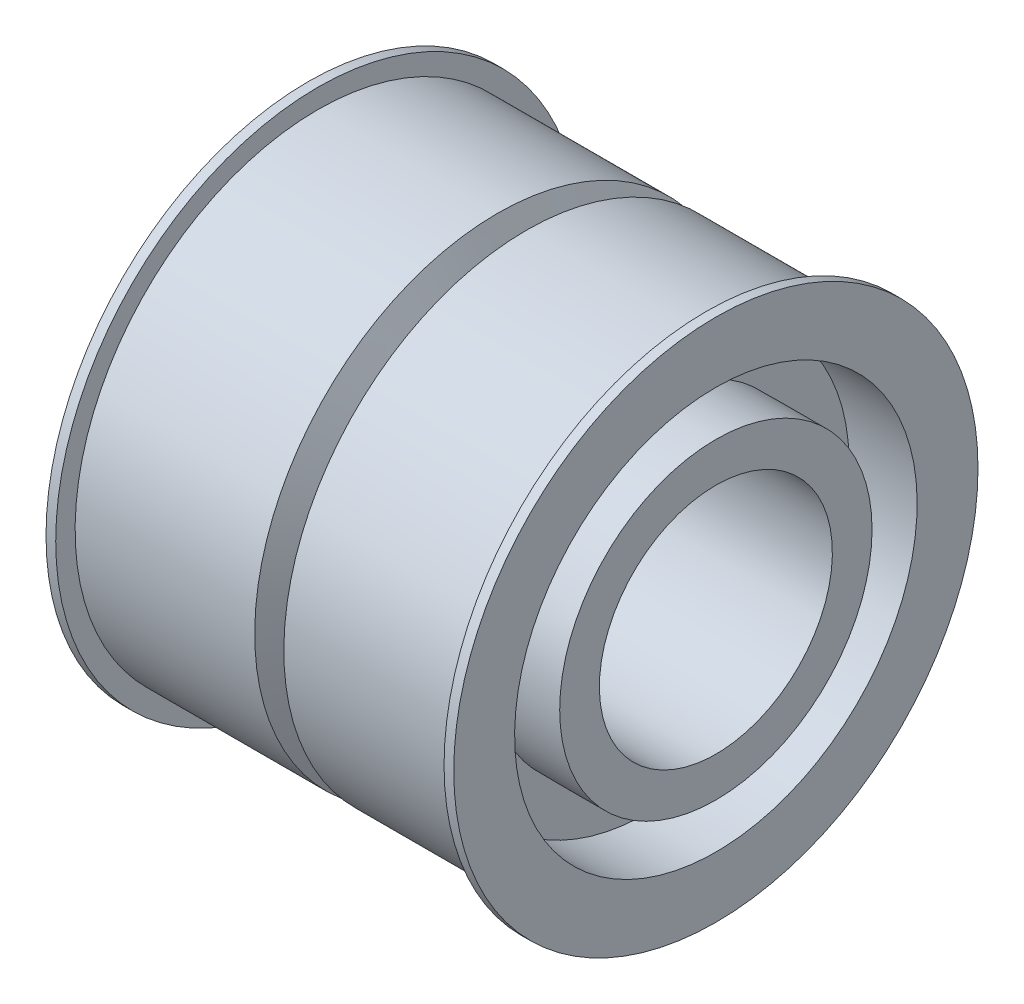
ISO-10303-21;
HEADER;
FILE_DESCRIPTION(('STEP AP214'),'2;1');
FILE_NAME('part.step','',(''),(''),'','','');
FILE_SCHEMA(('AUTOMOTIVE_DESIGN { 1 0 10303 214 1 1 1 1 }'));
ENDSEC;
DATA;
#1=APPLICATION_CONTEXT('core data for automotive mechanical design processes');
#2=APPLICATION_PROTOCOL_DEFINITION('international standard','automotive_design',2000,#1);
#3=PRODUCT_CONTEXT('',#1,'mechanical');
#4=PRODUCT('Part','Part','',(#3));
#5=PRODUCT_RELATED_PRODUCT_CATEGORY('part','',(#4));
#6=PRODUCT_DEFINITION_FORMATION('','',#4);
#7=PRODUCT_DEFINITION_CONTEXT('part definition',#1,'design');
#8=PRODUCT_DEFINITION('design','',#6,#7);
#9=PRODUCT_DEFINITION_SHAPE('','',#8);
#10=(LENGTH_UNIT() NAMED_UNIT(*) SI_UNIT(.MILLI.,.METRE.));
#11=(NAMED_UNIT(*) PLANE_ANGLE_UNIT() SI_UNIT($,.RADIAN.));
#12=(NAMED_UNIT(*) SI_UNIT($,.STERADIAN.) SOLID_ANGLE_UNIT());
#13=UNCERTAINTY_MEASURE_WITH_UNIT(LENGTH_MEASURE(1.E-05),#10,'distance_accuracy_value','');
#14=(GEOMETRIC_REPRESENTATION_CONTEXT(3) GLOBAL_UNCERTAINTY_ASSIGNED_CONTEXT((#13)) GLOBAL_UNIT_ASSIGNED_CONTEXT((#10,
#11,#12)) REPRESENTATION_CONTEXT('',''));
#15=CARTESIAN_POINT('',(0.,0.,0.));
#16=DIRECTION('',(0.,0.,1.));
#17=DIRECTION('',(1.,0.,0.));
#18=AXIS2_PLACEMENT_3D('',#15,#16,#17);
#19=CARTESIAN_POINT('',(0.,-1.95390895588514,0.));
#20=DIRECTION('',(-1.,0.,0.));
#21=DIRECTION('',(0.,-1.,0.));
#22=AXIS2_PLACEMENT_3D('',#19,#20,#21);
#23=PLANE('',#22);
#24=CARTESIAN_POINT('',(0.,-18.0255033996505,0.));
#25=DIRECTION('',(1.,0.,0.));
#26=DIRECTION('',(0.,1.,0.));
#27=AXIS2_PLACEMENT_3D('',#24,#25,#26);
#28=CIRCLE('',#27,12.);
#29=CARTESIAN_POINT('',(0.,-6.02550339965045,0.));
#30=VERTEX_POINT('',#29);
#31=EDGE_CURVE('E10',#30,#30,#28,.T.);
#32=ORIENTED_EDGE('',*,*,#31,.T.);
#33=EDGE_LOOP('',(#32));
#34=FACE_BOUND('',#33,.T.);
#35=CARTESIAN_POINT('',(0.,-18.0255033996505,0.));
#36=DIRECTION('',(1.,0.,0.));
#37=DIRECTION('',(0.,1.,0.));
#38=AXIS2_PLACEMENT_3D('',#35,#36,#37);
#39=CIRCLE('',#38,16.0715944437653);
#40=CARTESIAN_POINT('',(0.,-1.95390895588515,0.));
#41=VERTEX_POINT('',#40);
#42=EDGE_CURVE('E101',#41,#41,#39,.T.);
#43=ORIENTED_EDGE('',*,*,#42,.F.);
#44=EDGE_LOOP('',(#43));
#45=FACE_BOUND('',#44,.T.);
#46=ADVANCED_FACE('F40',(#34,#45),#23,.T.);
#47=CARTESIAN_POINT('',(42.,-18.0255033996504,0.));
#48=DIRECTION('',(1.,0.,0.));
#49=DIRECTION('',(0.,1.,0.));
#50=AXIS2_PLACEMENT_3D('',#47,#48,#49);
#51=CYLINDRICAL_SURFACE('',#50,12.);
#52=CARTESIAN_POINT('',(42.,-18.0255033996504,0.));
#53=DIRECTION('',(1.,0.,0.));
#54=DIRECTION('',(0.,1.,0.));
#55=AXIS2_PLACEMENT_3D('',#52,#53,#54);
#56=CIRCLE('',#55,12.);
#57=CARTESIAN_POINT('',(42.,-6.02550339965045,0.));
#58=VERTEX_POINT('',#57);
#59=EDGE_CURVE('E46',#58,#58,#56,.T.);
#60=ORIENTED_EDGE('',*,*,#59,.T.);
#61=EDGE_LOOP('',(#60));
#62=FACE_BOUND('',#61,.T.);
#63=ORIENTED_EDGE('',*,*,#31,.F.);
#64=EDGE_LOOP('',(#63));
#65=FACE_BOUND('',#64,.T.);
#66=ADVANCED_FACE('F109',(#62,#65),#51,.F.);
#67=CARTESIAN_POINT('',(42.,-6.02550339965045,0.));
#68=DIRECTION('',(1.,0.,0.));
#69=DIRECTION('',(0.,1.,0.));
#70=AXIS2_PLACEMENT_3D('',#67,#68,#69);
#71=PLANE('',#70);
#72=CARTESIAN_POINT('',(42.,-18.0255033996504,0.));
#73=DIRECTION('',(1.,0.,0.));
#74=DIRECTION('',(0.,1.,0.));
#75=AXIS2_PLACEMENT_3D('',#72,#73,#74);
#76=CIRCLE('',#75,16.0874399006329);
#77=CARTESIAN_POINT('',(42.,-1.93806349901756,0.));
#78=VERTEX_POINT('',#77);
#79=EDGE_CURVE('E50',#78,#78,#76,.T.);
#80=ORIENTED_EDGE('',*,*,#79,.T.);
#81=EDGE_LOOP('',(#80));
#82=FACE_BOUND('',#81,.T.);
#83=ORIENTED_EDGE('',*,*,#59,.F.);
#84=EDGE_LOOP('',(#83));
#85=FACE_BOUND('',#84,.T.);
#86=ADVANCED_FACE('F113',(#82,#85),#71,.T.);
#87=CARTESIAN_POINT('',(42.,-18.0255033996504,0.));
#88=DIRECTION('',(1.,0.,0.));
#89=DIRECTION('',(0.,1.,0.));
#90=AXIS2_PLACEMENT_3D('',#87,#88,#89);
#91=CONICAL_SURFACE('',#90,16.0874399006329,0.00226363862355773);
#92=CARTESIAN_POINT('',(35.0000179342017,-18.0255033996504,0.));
#93=DIRECTION('',(1.,0.,0.));
#94=DIRECTION('',(0.,1.,0.));
#95=AXIS2_PLACEMENT_3D('',#92,#93,#94);
#96=CIRCLE('',#95,16.0715944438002);
#97=CARTESIAN_POINT('',(35.0000179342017,-1.95390895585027,0.));
#98=VERTEX_POINT('',#97);
#99=EDGE_CURVE('E54',#98,#98,#96,.T.);
#100=ORIENTED_EDGE('',*,*,#99,.T.);
#101=EDGE_LOOP('',(#100));
#102=FACE_BOUND('',#101,.T.);
#103=ORIENTED_EDGE('',*,*,#79,.F.);
#104=EDGE_LOOP('',(#103));
#105=FACE_BOUND('',#104,.T.);
#106=ADVANCED_FACE('F117',(#102,#105),#91,.T.);
#107=CARTESIAN_POINT('',(35.0000179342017,-18.0255033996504,0.));
#108=DIRECTION('',(-1.,0.,0.));
#109=DIRECTION('',(0.,-1.,0.));
#110=AXIS2_PLACEMENT_3D('',#107,#108,#109);
#111=CONICAL_SURFACE('',#110,16.0715944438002,1.57079247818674);
#112=CARTESIAN_POINT('',(35.,-18.0255033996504,0.));
#113=DIRECTION('',(1.,0.,0.));
#114=DIRECTION('',(0.,1.,0.));
#115=AXIS2_PLACEMENT_3D('',#112,#113,#114);
#116=CIRCLE('',#115,20.7315132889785);
#117=CARTESIAN_POINT('',(35.,2.70600988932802,0.));
#118=VERTEX_POINT('',#117);
#119=EDGE_CURVE('E59',#118,#118,#116,.T.);
#120=ORIENTED_EDGE('',*,*,#119,.T.);
#121=EDGE_LOOP('',(#120));
#122=FACE_BOUND('',#121,.T.);
#123=ORIENTED_EDGE('',*,*,#99,.F.);
#124=EDGE_LOOP('',(#123));
#125=FACE_BOUND('',#124,.T.);
#126=ADVANCED_FACE('F124',(#122,#125),#111,.T.);
#127=CARTESIAN_POINT('',(42.,-18.0255033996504,0.));
#128=DIRECTION('',(1.,0.,0.));
#129=DIRECTION('',(0.,1.,0.));
#130=AXIS2_PLACEMENT_3D('',#127,#128,#129);
#131=CYLINDRICAL_SURFACE('',#130,20.7315132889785);
#132=CARTESIAN_POINT('',(42.,-18.0255033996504,0.));
#133=DIRECTION('',(1.,0.,0.));
#134=DIRECTION('',(0.,1.,0.));
#135=AXIS2_PLACEMENT_3D('',#132,#133,#134);
#136=CIRCLE('',#135,20.7315132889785);
#137=CARTESIAN_POINT('',(42.,2.70600988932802,0.));
#138=VERTEX_POINT('',#137);
#139=EDGE_CURVE('E62',#138,#138,#136,.T.);
#140=ORIENTED_EDGE('',*,*,#139,.T.);
#141=EDGE_LOOP('',(#140));
#142=FACE_BOUND('',#141,.T.);
#143=ORIENTED_EDGE('',*,*,#119,.F.);
#144=EDGE_LOOP('',(#143));
#145=FACE_BOUND('',#144,.T.);
#146=ADVANCED_FACE('F128',(#142,#145),#131,.F.);
#147=CARTESIAN_POINT('',(42.,6.97449660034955,0.));
#148=DIRECTION('',(1.,0.,0.));
#149=DIRECTION('',(0.,1.,0.));
#150=AXIS2_PLACEMENT_3D('',#147,#148,#149);
#151=PLANE('',#150);
#152=CARTESIAN_POINT('',(42.,-18.0255033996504,0.));
#153=DIRECTION('',(1.,0.,0.));
#154=DIRECTION('',(0.,1.,0.));
#155=AXIS2_PLACEMENT_3D('',#152,#153,#154);
#156=CIRCLE('',#155,27.);
#157=CARTESIAN_POINT('',(42.,8.97449660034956,0.));
#158=VERTEX_POINT('',#157);
#159=EDGE_CURVE('E65',#158,#158,#156,.T.);
#160=ORIENTED_EDGE('',*,*,#159,.T.);
#161=EDGE_LOOP('',(#160));
#162=FACE_BOUND('',#161,.T.);
#163=ORIENTED_EDGE('',*,*,#139,.F.);
#164=EDGE_LOOP('',(#163));
#165=FACE_BOUND('',#164,.T.);
#166=ADVANCED_FACE('F132',(#162,#165),#151,.T.);
#167=CARTESIAN_POINT('',(42.,-18.0255033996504,0.));
#168=DIRECTION('',(1.,0.,0.));
#169=DIRECTION('',(0.,1.,0.));
#170=AXIS2_PLACEMENT_3D('',#167,#168,#169);
#171=CYLINDRICAL_SURFACE('',#170,27.);
#172=CARTESIAN_POINT('',(41.,-18.0255033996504,0.));
#173=DIRECTION('',(1.,0.,0.));
#174=DIRECTION('',(0.,1.,0.));
#175=AXIS2_PLACEMENT_3D('',#172,#173,#174);
#176=CIRCLE('',#175,27.);
#177=CARTESIAN_POINT('',(41.,8.97449660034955,0.));
#178=VERTEX_POINT('',#177);
#179=EDGE_CURVE('E68',#178,#178,#176,.T.);
#180=ORIENTED_EDGE('',*,*,#179,.T.);
#181=EDGE_LOOP('',(#180));
#182=FACE_BOUND('',#181,.T.);
#183=ORIENTED_EDGE('',*,*,#159,.F.);
#184=EDGE_LOOP('',(#183));
#185=FACE_BOUND('',#184,.T.);
#186=ADVANCED_FACE('F136',(#182,#185),#171,.T.);
#187=CARTESIAN_POINT('',(41.,8.97449660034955,0.));
#188=DIRECTION('',(-1.,0.,0.));
#189=DIRECTION('',(0.,-1.,0.));
#190=AXIS2_PLACEMENT_3D('',#187,#188,#189);
#191=PLANE('',#190);
#192=CARTESIAN_POINT('',(41.,-18.0255033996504,0.));
#193=DIRECTION('',(1.,0.,0.));
#194=DIRECTION('',(0.,1.,0.));
#195=AXIS2_PLACEMENT_3D('',#192,#193,#194);
#196=CIRCLE('',#195,25.0016931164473);
#197=CARTESIAN_POINT('',(41.,6.97618971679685,0.));
#198=VERTEX_POINT('',#197);
#199=EDGE_CURVE('E71',#198,#198,#196,.T.);
#200=ORIENTED_EDGE('',*,*,#199,.T.);
#201=EDGE_LOOP('',(#200));
#202=FACE_BOUND('',#201,.T.);
#203=ORIENTED_EDGE('',*,*,#179,.F.);
#204=EDGE_LOOP('',(#203));
#205=FACE_BOUND('',#204,.T.);
#206=ADVANCED_FACE('F140',(#202,#205),#191,.T.);
#207=CARTESIAN_POINT('',(42.,-18.0255033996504,0.));
#208=DIRECTION('',(1.,0.,0.));
#209=DIRECTION('',(0.,1.,0.));
#210=AXIS2_PLACEMENT_3D('',#207,#208,#209);
#211=CYLINDRICAL_SURFACE('',#210,25.0016931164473);
#212=CARTESIAN_POINT('',(22.5,-18.0255033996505,0.));
#213=DIRECTION('',(1.,0.,0.));
#214=DIRECTION('',(0.,1.,0.));
#215=AXIS2_PLACEMENT_3D('',#212,#213,#214);
#216=CIRCLE('',#215,25.0016931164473);
#217=CARTESIAN_POINT('',(22.5,6.97618971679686,0.));
#218=VERTEX_POINT('',#217);
#219=EDGE_CURVE('E74',#218,#218,#216,.T.);
#220=ORIENTED_EDGE('',*,*,#219,.T.);
#221=EDGE_LOOP('',(#220));
#222=FACE_BOUND('',#221,.T.);
#223=ORIENTED_EDGE('',*,*,#199,.F.);
#224=EDGE_LOOP('',(#223));
#225=FACE_BOUND('',#224,.T.);
#226=ADVANCED_FACE('F144',(#222,#225),#211,.T.);
#227=CARTESIAN_POINT('',(22.5,-18.0255033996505,0.));
#228=DIRECTION('',(1.,0.,0.));
#229=DIRECTION('',(0.,1.,0.));
#230=AXIS2_PLACEMENT_3D('',#227,#228,#229);
#231=CONICAL_SURFACE('',#230,25.0016931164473,1.10714871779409);
#232=CARTESIAN_POINT('',(21.,-18.0255033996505,0.));
#233=DIRECTION('',(1.,0.,0.));
#234=DIRECTION('',(0.,1.,0.));
#235=AXIS2_PLACEMENT_3D('',#232,#233,#234);
#236=CIRCLE('',#235,22.0016931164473);
#237=CARTESIAN_POINT('',(21.,3.97618971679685,0.));
#238=VERTEX_POINT('',#237);
#239=EDGE_CURVE('E77',#238,#238,#236,.T.);
#240=ORIENTED_EDGE('',*,*,#239,.T.);
#241=EDGE_LOOP('',(#240));
#242=FACE_BOUND('',#241,.T.);
#243=ORIENTED_EDGE('',*,*,#219,.F.);
#244=EDGE_LOOP('',(#243));
#245=FACE_BOUND('',#244,.T.);
#246=ADVANCED_FACE('F148',(#242,#245),#231,.T.);
#247=CARTESIAN_POINT('',(21.,-18.0255033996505,0.));
#248=DIRECTION('',(-1.,0.,0.));
#249=DIRECTION('',(0.,-1.,0.));
#250=AXIS2_PLACEMENT_3D('',#247,#248,#249);
#251=CONICAL_SURFACE('',#250,22.0016931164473,1.10714871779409);
#252=CARTESIAN_POINT('',(19.5,-18.0255033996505,0.));
#253=DIRECTION('',(1.,0.,0.));
#254=DIRECTION('',(0.,1.,0.));
#255=AXIS2_PLACEMENT_3D('',#252,#253,#254);
#256=CIRCLE('',#255,25.0016931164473);
#257=CARTESIAN_POINT('',(19.5,6.97618971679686,0.));
#258=VERTEX_POINT('',#257);
#259=EDGE_CURVE('E80',#258,#258,#256,.T.);
#260=ORIENTED_EDGE('',*,*,#259,.T.);
#261=EDGE_LOOP('',(#260));
#262=FACE_BOUND('',#261,.T.);
#263=ORIENTED_EDGE('',*,*,#239,.F.);
#264=EDGE_LOOP('',(#263));
#265=FACE_BOUND('',#264,.T.);
#266=ADVANCED_FACE('F152',(#262,#265),#251,.T.);
#267=CARTESIAN_POINT('',(42.,-18.0255033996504,0.));
#268=DIRECTION('',(1.,0.,0.));
#269=DIRECTION('',(0.,1.,0.));
#270=AXIS2_PLACEMENT_3D('',#267,#268,#269);
#271=CYLINDRICAL_SURFACE('',#270,25.0016931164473);
#272=CARTESIAN_POINT('',(1.00000000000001,-18.0255033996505,0.));
#273=DIRECTION('',(1.,0.,0.));
#274=DIRECTION('',(0.,1.,0.));
#275=AXIS2_PLACEMENT_3D('',#272,#273,#274);
#276=CIRCLE('',#275,25.0016931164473);
#277=CARTESIAN_POINT('',(1.,6.97618971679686,0.));
#278=VERTEX_POINT('',#277);
#279=EDGE_CURVE('E83',#278,#278,#276,.T.);
#280=ORIENTED_EDGE('',*,*,#279,.T.);
#281=EDGE_LOOP('',(#280));
#282=FACE_BOUND('',#281,.T.);
#283=ORIENTED_EDGE('',*,*,#259,.F.);
#284=EDGE_LOOP('',(#283));
#285=FACE_BOUND('',#284,.T.);
#286=ADVANCED_FACE('F156',(#282,#285),#271,.T.);
#287=CARTESIAN_POINT('',(1.,8.97449660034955,0.));
#288=DIRECTION('',(1.,0.,0.));
#289=DIRECTION('',(0.,1.,0.));
#290=AXIS2_PLACEMENT_3D('',#287,#288,#289);
#291=PLANE('',#290);
#292=CARTESIAN_POINT('',(1.00000000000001,-18.0255033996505,0.));
#293=DIRECTION('',(1.,0.,0.));
#294=DIRECTION('',(0.,1.,0.));
#295=AXIS2_PLACEMENT_3D('',#292,#293,#294);
#296=CIRCLE('',#295,27.);
#297=CARTESIAN_POINT('',(1.,8.97449660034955,0.));
#298=VERTEX_POINT('',#297);
#299=EDGE_CURVE('E86',#298,#298,#296,.T.);
#300=ORIENTED_EDGE('',*,*,#299,.T.);
#301=EDGE_LOOP('',(#300));
#302=FACE_BOUND('',#301,.T.);
#303=ORIENTED_EDGE('',*,*,#279,.F.);
#304=EDGE_LOOP('',(#303));
#305=FACE_BOUND('',#304,.T.);
#306=ADVANCED_FACE('F160',(#302,#305),#291,.T.);
#307=CARTESIAN_POINT('',(42.,-18.0255033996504,0.));
#308=DIRECTION('',(1.,0.,0.));
#309=DIRECTION('',(0.,1.,0.));
#310=AXIS2_PLACEMENT_3D('',#307,#308,#309);
#311=CYLINDRICAL_SURFACE('',#310,27.);
#312=CARTESIAN_POINT('',(0.,-18.0255033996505,0.));
#313=DIRECTION('',(1.,0.,0.));
#314=DIRECTION('',(0.,1.,0.));
#315=AXIS2_PLACEMENT_3D('',#312,#313,#314);
#316=CIRCLE('',#315,27.);
#317=CARTESIAN_POINT('',(0.,8.97449660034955,0.));
#318=VERTEX_POINT('',#317);
#319=EDGE_CURVE('E89',#318,#318,#316,.T.);
#320=ORIENTED_EDGE('',*,*,#319,.T.);
#321=EDGE_LOOP('',(#320));
#322=FACE_BOUND('',#321,.T.);
#323=ORIENTED_EDGE('',*,*,#299,.F.);
#324=EDGE_LOOP('',(#323));
#325=FACE_BOUND('',#324,.T.);
#326=ADVANCED_FACE('F164',(#322,#325),#311,.T.);
#327=CARTESIAN_POINT('',(0.,2.70600988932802,0.));
#328=DIRECTION('',(-1.,0.,0.));
#329=DIRECTION('',(0.,-1.,0.));
#330=AXIS2_PLACEMENT_3D('',#327,#328,#329);
#331=PLANE('',#330);
#332=CARTESIAN_POINT('',(0.,-18.0255033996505,0.));
#333=DIRECTION('',(1.,0.,0.));
#334=DIRECTION('',(0.,1.,0.));
#335=AXIS2_PLACEMENT_3D('',#332,#333,#334);
#336=CIRCLE('',#335,20.7315132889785);
#337=CARTESIAN_POINT('',(0.,2.70600988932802,0.));
#338=VERTEX_POINT('',#337);
#339=EDGE_CURVE('E92',#338,#338,#336,.T.);
#340=ORIENTED_EDGE('',*,*,#339,.T.);
#341=EDGE_LOOP('',(#340));
#342=FACE_BOUND('',#341,.T.);
#343=ORIENTED_EDGE('',*,*,#319,.F.);
#344=EDGE_LOOP('',(#343));
#345=FACE_BOUND('',#344,.T.);
#346=ADVANCED_FACE('F168',(#342,#345),#331,.T.);
#347=CARTESIAN_POINT('',(42.,-18.0255033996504,0.));
#348=DIRECTION('',(1.,0.,0.));
#349=DIRECTION('',(0.,1.,0.));
#350=AXIS2_PLACEMENT_3D('',#347,#348,#349);
#351=CYLINDRICAL_SURFACE('',#350,20.7315132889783);
#352=CARTESIAN_POINT('',(7.,-18.0255033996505,0.));
#353=DIRECTION('',(1.,0.,0.));
#354=DIRECTION('',(0.,1.,0.));
#355=AXIS2_PLACEMENT_3D('',#352,#353,#354);
#356=CIRCLE('',#355,20.7315132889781);
#357=CARTESIAN_POINT('',(7.,2.70600988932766,0.));
#358=VERTEX_POINT('',#357);
#359=EDGE_CURVE('E95',#358,#358,#356,.T.);
#360=ORIENTED_EDGE('',*,*,#359,.T.);
#361=EDGE_LOOP('',(#360));
#362=FACE_BOUND('',#361,.T.);
#363=ORIENTED_EDGE('',*,*,#339,.F.);
#364=EDGE_LOOP('',(#363));
#365=FACE_BOUND('',#364,.T.);
#366=ADVANCED_FACE('F172',(#362,#365),#351,.F.);
#367=CARTESIAN_POINT('',(7.,-1.95390895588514,0.));
#368=DIRECTION('',(-1.,0.,0.));
#369=DIRECTION('',(0.,-1.,0.));
#370=AXIS2_PLACEMENT_3D('',#367,#368,#369);
#371=PLANE('',#370);
#372=CARTESIAN_POINT('',(7.,-18.0255033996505,0.));
#373=DIRECTION('',(1.,0.,0.));
#374=DIRECTION('',(0.,1.,0.));
#375=AXIS2_PLACEMENT_3D('',#372,#373,#374);
#376=CIRCLE('',#375,16.0715944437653);
#377=CARTESIAN_POINT('',(7.,-1.95390895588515,0.));
#378=VERTEX_POINT('',#377);
#379=EDGE_CURVE('E98',#378,#378,#376,.T.);
#380=ORIENTED_EDGE('',*,*,#379,.T.);
#381=EDGE_LOOP('',(#380));
#382=FACE_BOUND('',#381,.T.);
#383=ORIENTED_EDGE('',*,*,#359,.F.);
#384=EDGE_LOOP('',(#383));
#385=FACE_BOUND('',#384,.T.);
#386=ADVANCED_FACE('F176',(#382,#385),#371,.T.);
#387=CARTESIAN_POINT('',(42.,-18.0255033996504,0.));
#388=DIRECTION('',(1.,0.,0.));
#389=DIRECTION('',(0.,1.,0.));
#390=AXIS2_PLACEMENT_3D('',#387,#388,#389);
#391=CYLINDRICAL_SURFACE('',#390,16.0715944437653);
#392=ORIENTED_EDGE('',*,*,#42,.T.);
#393=EDGE_LOOP('',(#392));
#394=FACE_BOUND('',#393,.T.);
#395=ORIENTED_EDGE('',*,*,#379,.F.);
#396=EDGE_LOOP('',(#395));
#397=FACE_BOUND('',#396,.T.);
#398=ADVANCED_FACE('F105',(#394,#397),#391,.T.);
#399=CLOSED_SHELL('',(#46,#66,#86,#106,#126,#146,#166,#186,#206,#226,#246,#266,#286,#306,#326,
#346,#366,#386,#398));
#400=MANIFOLD_SOLID_BREP('B2',#399);
#401=ADVANCED_BREP_SHAPE_REPRESENTATION('',(#18,#400),#14);
#402=SHAPE_DEFINITION_REPRESENTATION(#9,#401);
ENDSEC;
END-ISO-10303-21;
